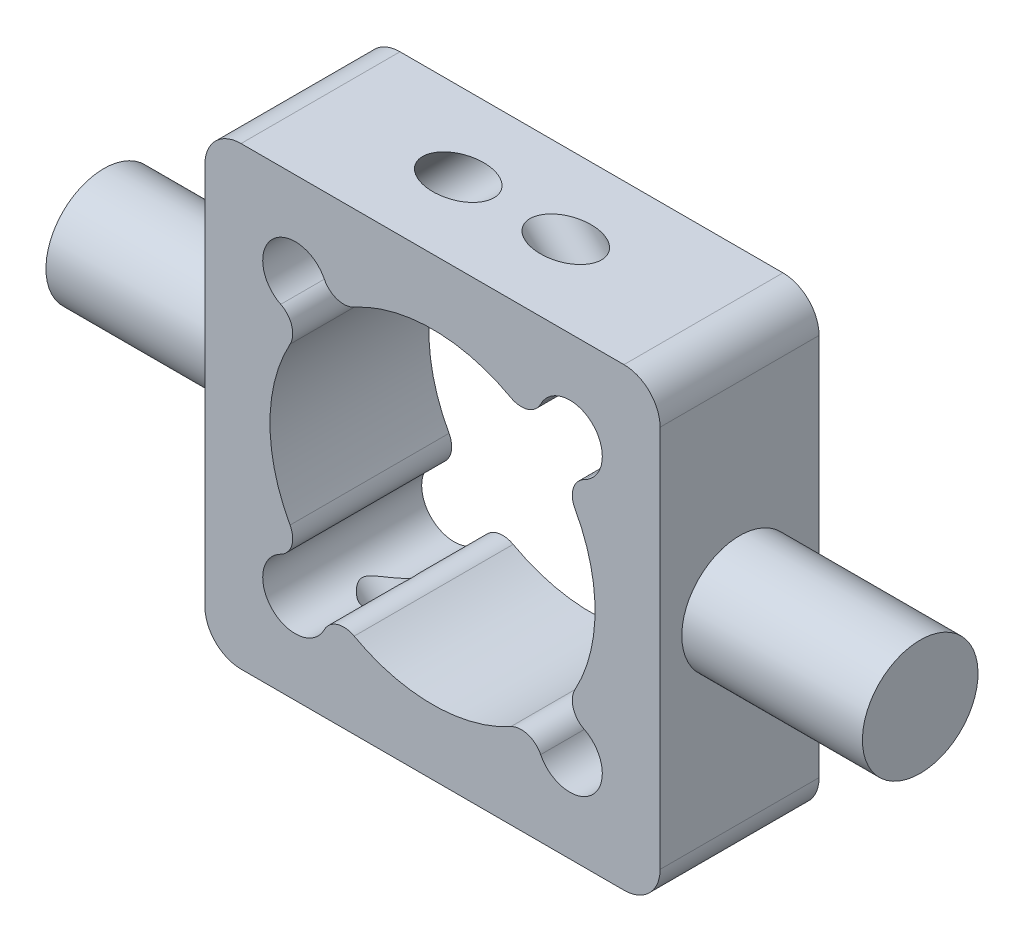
from build123d import *

# Parameters (mm, degrees)
ESBO_O1_W                 = 63
ESBO_O1_H                 = 63
EXTRUS_O1_DEPTH           = 22
ESBO_O2_R                 = 8
EXTRUS_O2_DEPTH           = 25
FILETE2_R                 = 5
ESBO_O6_R                 = 3.5
EXTRUS_O5_DEPTH           = 25
ESPELHAR3_COPY_1_SKETCH_R = 3.5
ESPELHAR3_COPY_1_DEPTH    = 25


with BuildPart() as part:
    # Esbo_o1 → Extrus_o1 (new body)
    with BuildSketch(Plane.XY):
        Rectangle(ESBO_O1_W, ESBO_O1_H)
        with BuildLine():
            ThreePointArc((-19.715779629, 10.841495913), (-22.5, 0), (-19.715779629, -10.841495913))
            ThreePointArc((-19.715779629, -10.841495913), (-19.481130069, -13.181916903), (-21.006730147, -14.972217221))
            ThreePointArc((-21.006730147, -14.972217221), (-22.181980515, -22.181980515), (-14.972217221, -21.006730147))
            ThreePointArc((-14.972217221, -21.006730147), (-13.181916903, -19.481130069), (-10.841495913, -19.715779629))
            ThreePointArc((-10.841495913, -19.715779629), (0, -22.5), (10.841495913, -19.715779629))
            ThreePointArc((10.841495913, -19.715779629), (13.181916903, -19.481130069), (14.972217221, -21.006730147))
            ThreePointArc((14.972217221, -21.006730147), (22.181980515, -22.181980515), (21.006730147, -14.972217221))
            ThreePointArc((21.006730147, -14.972217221), (19.481130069, -13.181916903), (19.715779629, -10.841495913))
            ThreePointArc((19.715779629, -10.841495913), (22.5, 0), (19.715779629, 10.841495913))
            ThreePointArc((19.715779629, 10.841495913), (19.481130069, 13.181916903), (21.006730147, 14.972217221))
            ThreePointArc((21.006730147, 14.972217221), (22.181980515, 22.181980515), (14.972217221, 21.006730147))
            ThreePointArc((14.972217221, 21.006730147), (13.181916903, 19.481130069), (10.841495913, 19.715779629))
            ThreePointArc((10.841495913, 19.715779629), (0, 22.5), (-10.841495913, 19.715779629))
            ThreePointArc((-10.841495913, 19.715779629), (-13.181916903, 19.481130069), (-14.972217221, 21.006730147))
            ThreePointArc((-14.972217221, 21.006730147), (-22.181980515, 22.181980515), (-21.006730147, 14.972217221))
            ThreePointArc((-21.006730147, 14.972217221), (-19.481130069, 13.181916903), (-19.715779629, 10.841495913))
        make_face(mode=Mode.SUBTRACT)
    extrude(amount=EXTRUS_O1_DEPTH)

    # Esbo_o2 → Extrus_o2 (add)
    with BuildSketch(Plane.ZY.offset(31.5)):
        with Locations(Location((11, 0, 0), (0, 0, 180))):
            Circle(ESBO_O2_R)
    extrus_o2 = extrude(amount=EXTRUS_O2_DEPTH)

    # Espelhar1: Extrus_o2 across plane
    add(extrus_o2.mirror(Plane(origin=(0, 0, 0), x_dir=(0, 0, 1), z_dir=(1, 0, 0))))

    # Filete2
    filete2_edges = [part.edges().sort_by_distance(p)[0] for p in [
        (-31.5, 31.5, 11),
        (31.5, 31.5, 11),
        (31.5, -31.5, 11),
        (-31.5, -31.5, 11),
    ]]
    fillet(filete2_edges, radius=FILETE2_R)

    # Esbo_o6 → Extrus_o5 (cut)
    with BuildSketch(Plane(origin=(-18.195946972, 18.195946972, 0), x_dir=(0.7071067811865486, 0.7071067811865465, 0), z_dir=(0.7071067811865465, -0.7071067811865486, 0))):
        with Locations(Location((27.535533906, 11, 0), (0, 0, 180))):
            Circle(ESBO_O6_R)
    extrus_o5 = extrude(amount=EXTRUS_O5_DEPTH, mode=Mode.SUBTRACT)

    # Espelhar2: Extrus_o5 across plane
    add(extrus_o5.mirror(Plane(origin=(0, 0, 0), x_dir=(0, 0, 1), z_dir=(1, 0, 0))), mode=Mode.SUBTRACT)

    # Espelhar3: Extrus_o5 across plane
    add(extrus_o5.mirror(Plane.ZX), mode=Mode.SUBTRACT)

    # Espelhar3 copy 1 sketch → Espelhar3 copy 1 (cut)
    with BuildSketch(Plane(origin=(18.195946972, -18.195946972, 0), x_dir=(-0.707106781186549, -0.707106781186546, 0), z_dir=(-0.707106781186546, 0.707106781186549, 0))):
        with Locations(Location((27.535533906, 11, 0), (0, 0, 180))):
            Circle(ESPELHAR3_COPY_1_SKETCH_R)
    extrude(amount=ESPELHAR3_COPY_1_DEPTH, mode=Mode.SUBTRACT)


solid = part.part
